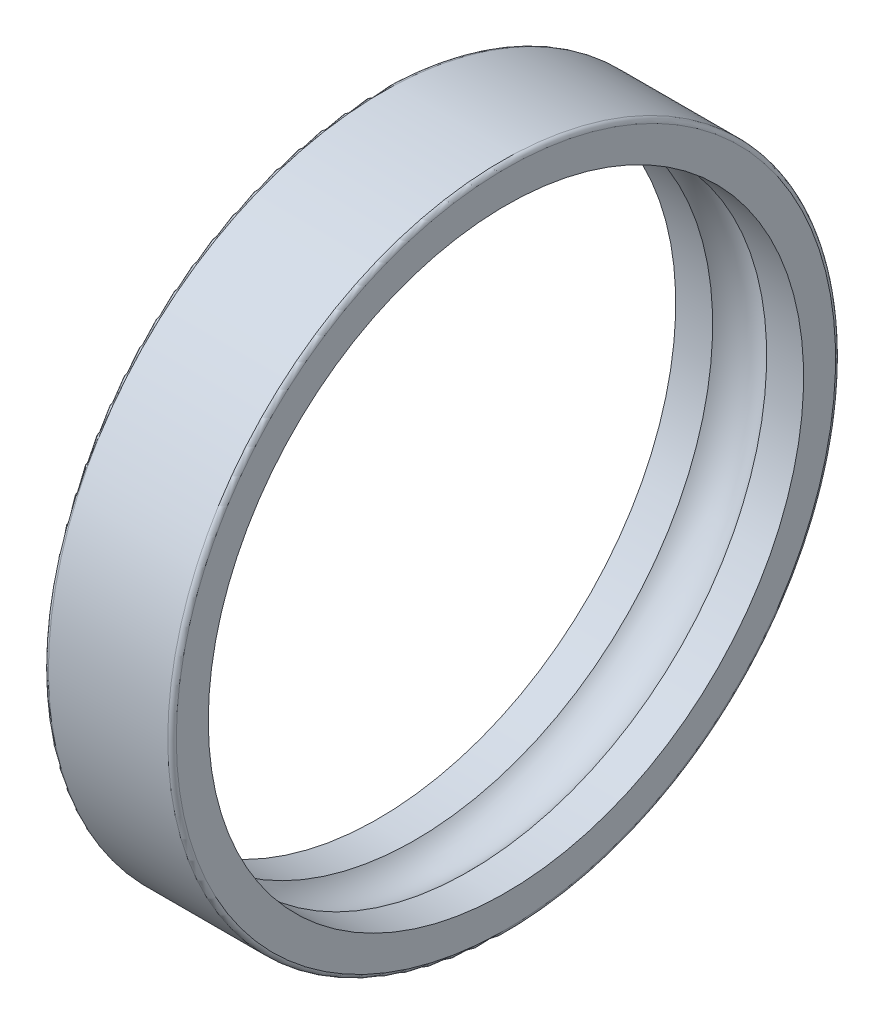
from build123d import *


with BuildPart() as part:
    # Esquisse1 → Base-R_volution (revolve)
    with BuildSketch(Plane(origin=(0, 0, 0), x_dir=(1, 0, 0), z_dir=(0, 1, 0)), mode=Mode.PRIVATE) as base_r_volution_sk:
        with BuildLine():
            Line((0, 23.2), (0, 20.95))
            Line((0, 20.95), (2.599342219, 20.95))
            ThreePointArc((2.599342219, 20.95), (4.5, 21.8), (6.400657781, 20.95))
            Line((6.400657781, 20.95), (9, 20.95))
            Line((9, 20.95), (9, 23.2))
            ThreePointArc((9, 23.2), (8.912132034, 23.412132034), (8.7, 23.5))
            Line((8.7, 23.5), (0.3, 23.5))
            ThreePointArc((0.3, 23.5), (0.087867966, 23.412132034), (0, 23.2))
        make_face()
    revolve(base_r_volution_sk.sketch.rotate(Axis((0, 0, 0), (1, 0, 0)), 180), axis=Axis((0, 0, 0), (1, 0, 0)))


solid = part.part
